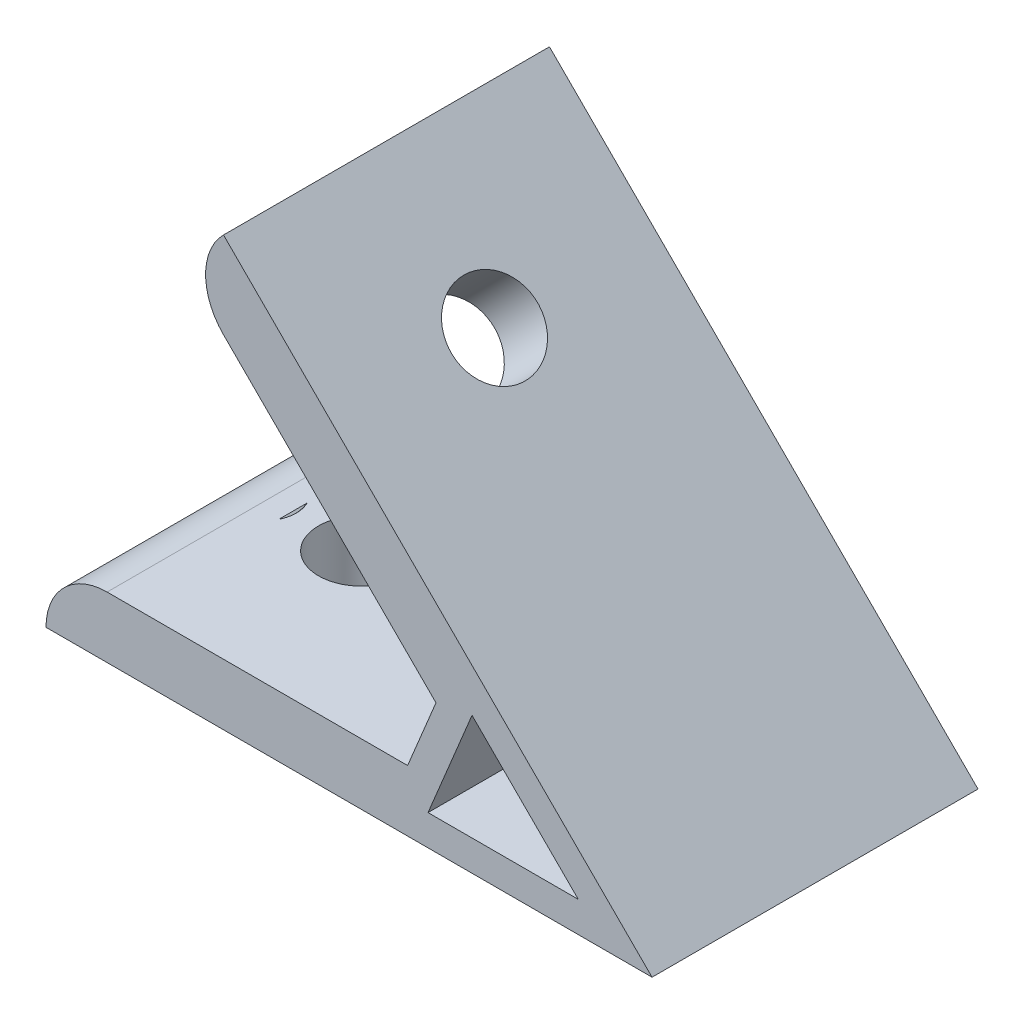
ISO-10303-21;
HEADER;
FILE_DESCRIPTION(('STEP AP214'),'2;1');
FILE_NAME('part.step','',(''),(''),'','','');
FILE_SCHEMA(('AUTOMOTIVE_DESIGN { 1 0 10303 214 1 1 1 1 }'));
ENDSEC;
DATA;
#1=APPLICATION_CONTEXT('core data for automotive mechanical design processes');
#2=APPLICATION_PROTOCOL_DEFINITION('international standard','automotive_design',2000,#1);
#3=PRODUCT_CONTEXT('',#1,'mechanical');
#4=PRODUCT('Part','Part','',(#3));
#5=PRODUCT_RELATED_PRODUCT_CATEGORY('part','',(#4));
#6=PRODUCT_DEFINITION_FORMATION('','',#4);
#7=PRODUCT_DEFINITION_CONTEXT('part definition',#1,'design');
#8=PRODUCT_DEFINITION('design','',#6,#7);
#9=PRODUCT_DEFINITION_SHAPE('','',#8);
#10=(LENGTH_UNIT() NAMED_UNIT(*) SI_UNIT(.MILLI.,.METRE.));
#11=(NAMED_UNIT(*) PLANE_ANGLE_UNIT() SI_UNIT($,.RADIAN.));
#12=(NAMED_UNIT(*) SI_UNIT($,.STERADIAN.) SOLID_ANGLE_UNIT());
#13=UNCERTAINTY_MEASURE_WITH_UNIT(LENGTH_MEASURE(1.E-05),#10,'distance_accuracy_value','');
#14=(GEOMETRIC_REPRESENTATION_CONTEXT(3) GLOBAL_UNCERTAINTY_ASSIGNED_CONTEXT((#13)) GLOBAL_UNIT_ASSIGNED_CONTEXT((#10,
#11,#12)) REPRESENTATION_CONTEXT('',''));
#15=CARTESIAN_POINT('',(0.,0.,0.));
#16=DIRECTION('',(0.,0.,1.));
#17=DIRECTION('',(1.,0.,0.));
#18=AXIS2_PLACEMENT_3D('',#15,#16,#17);
#19=CARTESIAN_POINT('',(0.,0.,16.));
#20=DIRECTION('',(0.,1.,0.));
#21=DIRECTION('',(0.,0.,1.));
#22=AXIS2_PLACEMENT_3D('',#19,#20,#21);
#23=PLANE('',#22);
#24=DIRECTION('',(1.,0.,0.));
#25=VECTOR('',#24,1.);
#26=CARTESIAN_POINT('',(0.,0.,-16.));
#27=LINE('',#26,#25);
#28=CARTESIAN_POINT('',(0.,0.,-16.));
#29=VERTEX_POINT('',#28);
#30=CARTESIAN_POINT('',(59.5,0.,-16.));
#31=VERTEX_POINT('',#30);
#32=EDGE_CURVE('E163',#29,#31,#27,.T.);
#33=ORIENTED_EDGE('',*,*,#32,.T.);
#34=DIRECTION('',(0.,0.,-1.));
#35=VECTOR('',#34,1.);
#36=CARTESIAN_POINT('',(59.5,0.,16.));
#37=LINE('',#36,#35);
#38=CARTESIAN_POINT('',(59.5,0.,16.));
#39=VERTEX_POINT('',#38);
#40=EDGE_CURVE('E199',#39,#31,#37,.T.);
#41=ORIENTED_EDGE('',*,*,#40,.F.);
#42=DIRECTION('',(1.,0.,0.));
#43=VECTOR('',#42,1.);
#44=CARTESIAN_POINT('',(0.,0.,16.));
#45=LINE('',#44,#43);
#46=CARTESIAN_POINT('',(0.,0.,16.));
#47=VERTEX_POINT('',#46);
#48=EDGE_CURVE('E168',#47,#39,#45,.T.);
#49=ORIENTED_EDGE('',*,*,#48,.F.);
#50=DIRECTION('',(0.,0.,-1.));
#51=VECTOR('',#50,1.);
#52=CARTESIAN_POINT('',(0.,0.,16.));
#53=LINE('',#52,#51);
#54=EDGE_CURVE('E202',#47,#29,#53,.T.);
#55=ORIENTED_EDGE('',*,*,#54,.T.);
#56=EDGE_LOOP('',(#33,#41,#49,#55));
#57=FACE_BOUND('',#56,.T.);
#58=CARTESIAN_POINT('',(15.,0.,0.));
#59=DIRECTION('',(0.,1.,0.));
#60=DIRECTION('',(-1.,0.,0.));
#61=AXIS2_PLACEMENT_3D('',#58,#59,#60);
#62=CIRCLE('',#61,4.25);
#63=CARTESIAN_POINT('',(10.75,0.,0.));
#64=VERTEX_POINT('',#63);
#65=EDGE_CURVE('E129',#64,#64,#62,.T.);
#66=ORIENTED_EDGE('',*,*,#65,.T.);
#67=EDGE_LOOP('',(#66));
#68=FACE_BOUND('',#67,.T.);
#69=ADVANCED_FACE('F36',(#57,#68),#23,.F.);
#70=CARTESIAN_POINT('',(13.1845058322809,37.83021279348,16.));
#71=DIRECTION('',(0.707106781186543,0.707106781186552,0.));
#72=DIRECTION('',(-0.707106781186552,0.707106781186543,0.));
#73=AXIS2_PLACEMENT_3D('',#70,#71,#72);
#74=PLANE('',#73);
#75=DIRECTION('',(0.707106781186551,-0.707106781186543,0.));
#76=VECTOR('',#75,1.);
#77=CARTESIAN_POINT('',(13.1845058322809,37.83021279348,16.));
#78=LINE('',#77,#76);
#79=CARTESIAN_POINT('',(17.4271465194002,33.5875721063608,16.));
#80=VERTEX_POINT('',#79);
#81=CARTESIAN_POINT('',(38.2867965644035,12.7279220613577,16.));
#82=VERTEX_POINT('',#81);
#83=EDGE_CURVE('E173',#80,#82,#78,.T.);
#84=ORIENTED_EDGE('',*,*,#83,.F.);
#85=DIRECTION('',(0.,0.,-1.));
#86=VECTOR('',#85,1.);
#87=CARTESIAN_POINT('',(17.4271465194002,33.5875721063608,16.));
#88=LINE('',#87,#86);
#89=CARTESIAN_POINT('',(17.4271465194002,33.5875721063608,-16.));
#90=VERTEX_POINT('',#89);
#91=EDGE_CURVE('E205',#80,#90,#88,.T.);
#92=ORIENTED_EDGE('',*,*,#91,.T.);
#93=DIRECTION('',(0.707106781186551,-0.707106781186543,0.));
#94=VECTOR('',#93,1.);
#95=CARTESIAN_POINT('',(13.1845058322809,37.83021279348,-16.));
#96=LINE('',#95,#94);
#97=CARTESIAN_POINT('',(38.2867965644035,12.7279220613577,-16.));
#98=VERTEX_POINT('',#97);
#99=EDGE_CURVE('E185',#90,#98,#96,.T.);
#100=ORIENTED_EDGE('',*,*,#99,.T.);
#101=DIRECTION('',(0.,0.,-1.));
#102=VECTOR('',#101,1.);
#103=CARTESIAN_POINT('',(38.2867965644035,12.7279220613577,16.));
#104=LINE('',#103,#102);
#105=EDGE_CURVE('E193',#82,#98,#104,.T.);
#106=ORIENTED_EDGE('',*,*,#105,.F.);
#107=EDGE_LOOP('',(#84,#92,#100,#106));
#108=FACE_BOUND('',#107,.T.);
#109=CARTESIAN_POINT('',(23.7911075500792,27.2236110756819,0.));
#110=DIRECTION('',(0.707106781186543,0.707106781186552,0.));
#111=DIRECTION('',(-0.707106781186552,0.707106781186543,0.));
#112=AXIS2_PLACEMENT_3D('',#109,#110,#111);
#113=CIRCLE('',#112,4.25);
#114=CARTESIAN_POINT('',(20.7859037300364,30.2288148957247,0.));
#115=VERTEX_POINT('',#114);
#116=EDGE_CURVE('E139',#115,#115,#113,.T.);
#117=ORIENTED_EDGE('',*,*,#116,.T.);
#118=EDGE_LOOP('',(#117));
#119=FACE_BOUND('',#118,.T.);
#120=CARTESIAN_POINT('',(15.,36.014718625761,0.));
#121=DIRECTION('',(0.707106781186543,0.707106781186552,0.));
#122=DIRECTION('',(0.707106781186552,-0.707106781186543,0.));
#123=AXIS2_PLACEMENT_3D('',#120,#121,#122);
#124=ELLIPSE('',#123,6.01040764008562,4.25);
#125=CARTESIAN_POINT('',(19.014718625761,32.,-1.39446561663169));
#126=VERTEX_POINT('',#125);
#127=CARTESIAN_POINT('',(19.014718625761,32.,1.39446561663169));
#128=VERTEX_POINT('',#127);
#129=EDGE_CURVE('E127',#126,#128,#124,.F.);
#130=ORIENTED_EDGE('',*,*,#129,.F.);
#131=DIRECTION('',(0.,0.,-1.));
#132=VECTOR('',#131,1.);
#133=CARTESIAN_POINT('',(19.014718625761,32.,16.));
#134=LINE('',#133,#132);
#135=EDGE_CURVE('E11',#128,#126,#134,.T.);
#136=ORIENTED_EDGE('',*,*,#135,.F.);
#137=EDGE_LOOP('',(#130,#136));
#138=FACE_BOUND('',#137,.T.);
#139=ADVANCED_FACE('F131',(#108,#119,#138),#74,.F.);
#140=CARTESIAN_POINT('',(35.5,6.,16.));
#141=DIRECTION('',(0.,-1.,0.));
#142=DIRECTION('',(1.,0.,0.));
#143=AXIS2_PLACEMENT_3D('',#140,#141,#142);
#144=PLANE('',#143);
#145=DIRECTION('',(-1.,0.,0.));
#146=VECTOR('',#145,1.);
#147=CARTESIAN_POINT('',(35.5,6.,-16.));
#148=LINE('',#147,#146);
#149=CARTESIAN_POINT('',(35.5,6.,-16.));
#150=VERTEX_POINT('',#149);
#151=CARTESIAN_POINT('',(6.,6.,-16.));
#152=VERTEX_POINT('',#151);
#153=EDGE_CURVE('E171',#150,#152,#148,.T.);
#154=ORIENTED_EDGE('',*,*,#153,.T.);
#155=DIRECTION('',(0.,0.,-1.));
#156=VECTOR('',#155,1.);
#157=CARTESIAN_POINT('',(6.,6.,16.));
#158=LINE('',#157,#156);
#159=CARTESIAN_POINT('',(6.,6.,16.));
#160=VERTEX_POINT('',#159);
#161=EDGE_CURVE('E214',#152,#160,#158,.F.);
#162=ORIENTED_EDGE('',*,*,#161,.T.);
#163=DIRECTION('',(-1.,0.,0.));
#164=VECTOR('',#163,1.);
#165=CARTESIAN_POINT('',(35.5,6.,16.));
#166=LINE('',#165,#164);
#167=CARTESIAN_POINT('',(35.5,6.,16.));
#168=VERTEX_POINT('',#167);
#169=EDGE_CURVE('E177',#168,#160,#166,.T.);
#170=ORIENTED_EDGE('',*,*,#169,.F.);
#171=DIRECTION('',(0.,0.,-1.));
#172=VECTOR('',#171,1.);
#173=CARTESIAN_POINT('',(35.5,6.,16.));
#174=LINE('',#173,#172);
#175=EDGE_CURVE('E180',#168,#150,#174,.T.);
#176=ORIENTED_EDGE('',*,*,#175,.T.);
#177=EDGE_LOOP('',(#154,#162,#170,#176));
#178=FACE_BOUND('',#177,.T.);
#179=DIRECTION('',(0.,0.,1.));
#180=VECTOR('',#179,1.);
#181=CARTESIAN_POINT('',(8.24516600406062,6.,16.));
#182=LINE('',#181,#180);
#183=CARTESIAN_POINT('',(8.24516600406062,6.,-1.39446561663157));
#184=VERTEX_POINT('',#183);
#185=CARTESIAN_POINT('',(8.24516600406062,6.,1.39446561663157));
#186=VERTEX_POINT('',#185);
#187=EDGE_CURVE('E218',#184,#186,#182,.T.);
#188=ORIENTED_EDGE('',*,*,#187,.F.);
#189=CARTESIAN_POINT('',(2.56749647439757,6.,0.));
#190=DIRECTION('',(0.,-1.,0.));
#191=DIRECTION('',(1.,0.,0.));
#192=AXIS2_PLACEMENT_3D('',#189,#190,#191);
#193=ELLIPSE('',#192,6.01040764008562,4.25);
#194=EDGE_CURVE('E44',#184,#186,#193,.T.);
#195=ORIENTED_EDGE('',*,*,#194,.T.);
#196=EDGE_LOOP('',(#188,#195));
#197=FACE_BOUND('',#196,.T.);
#198=CARTESIAN_POINT('',(15.,6.,0.));
#199=DIRECTION('',(0.,-1.,0.));
#200=DIRECTION('',(1.,0.,0.));
#201=AXIS2_PLACEMENT_3D('',#198,#199,#200);
#202=CIRCLE('',#201,4.25);
#203=CARTESIAN_POINT('',(19.25,6.,0.));
#204=VERTEX_POINT('',#203);
#205=EDGE_CURVE('E128',#204,#204,#202,.F.);
#206=ORIENTED_EDGE('',*,*,#205,.F.);
#207=EDGE_LOOP('',(#206));
#208=FACE_BOUND('',#207,.T.);
#209=ADVANCED_FACE('F223',(#178,#197,#208),#144,.F.);
#210=CARTESIAN_POINT('',(59.5,0.,16.));
#211=DIRECTION('',(-0.707106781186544,-0.707106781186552,0.));
#212=DIRECTION('',(0.707106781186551,-0.707106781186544,0.));
#213=AXIS2_PLACEMENT_3D('',#210,#211,#212);
#214=PLANE('',#213);
#215=CARTESIAN_POINT('',(28.0337482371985,31.4662517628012,0.));
#216=DIRECTION('',(0.707106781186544,0.707106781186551,0.));
#217=DIRECTION('',(-0.707106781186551,0.707106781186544,0.));
#218=AXIS2_PLACEMENT_3D('',#215,#216,#217);
#219=CIRCLE('',#218,4.25);
#220=CARTESIAN_POINT('',(25.0285444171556,34.471455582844,0.));
#221=VERTEX_POINT('',#220);
#222=EDGE_CURVE('E132',#221,#221,#219,.T.);
#223=ORIENTED_EDGE('',*,*,#222,.F.);
#224=EDGE_LOOP('',(#223));
#225=FACE_BOUND('',#224,.T.);
#226=DIRECTION('',(-0.707106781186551,0.707106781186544,0.));
#227=VECTOR('',#226,1.);
#228=CARTESIAN_POINT('',(59.5,0.,-16.));
#229=LINE('',#228,#227);
#230=CARTESIAN_POINT('',(17.4271465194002,42.0728534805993,-16.));
#231=VERTEX_POINT('',#230);
#232=EDGE_CURVE('E182',#31,#231,#229,.T.);
#233=ORIENTED_EDGE('',*,*,#232,.T.);
#234=DIRECTION('',(0.,0.,-1.));
#235=VECTOR('',#234,1.);
#236=CARTESIAN_POINT('',(17.4271465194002,42.0728534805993,16.));
#237=LINE('',#236,#235);
#238=CARTESIAN_POINT('',(17.4271465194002,42.0728534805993,16.));
#239=VERTEX_POINT('',#238);
#240=EDGE_CURVE('E196',#239,#231,#237,.T.);
#241=ORIENTED_EDGE('',*,*,#240,.F.);
#242=DIRECTION('',(-0.707106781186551,0.707106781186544,0.));
#243=VECTOR('',#242,1.);
#244=CARTESIAN_POINT('',(59.5,0.,16.));
#245=LINE('',#244,#243);
#246=EDGE_CURVE('E170',#39,#239,#245,.T.);
#247=ORIENTED_EDGE('',*,*,#246,.F.);
#248=ORIENTED_EDGE('',*,*,#40,.T.);
#249=EDGE_LOOP('',(#233,#241,#247,#248));
#250=FACE_BOUND('',#249,.T.);
#251=ADVANCED_FACE('F249',(#225,#250),#214,.F.);
#252=CARTESIAN_POINT('',(38.2867965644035,12.7279220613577,16.));
#253=DIRECTION('',(0.923879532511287,-0.382683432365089,0.));
#254=DIRECTION('',(0.382683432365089,0.923879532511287,0.));
#255=AXIS2_PLACEMENT_3D('',#252,#253,#254);
#256=PLANE('',#255);
#257=DIRECTION('',(-0.382683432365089,-0.923879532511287,0.));
#258=VECTOR('',#257,1.);
#259=CARTESIAN_POINT('',(38.2867965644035,12.7279220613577,-16.));
#260=LINE('',#259,#258);
#261=EDGE_CURVE('E187',#98,#150,#260,.T.);
#262=ORIENTED_EDGE('',*,*,#261,.T.);
#263=ORIENTED_EDGE('',*,*,#175,.F.);
#264=DIRECTION('',(-0.382683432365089,-0.923879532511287,0.));
#265=VECTOR('',#264,1.);
#266=CARTESIAN_POINT('',(38.2867965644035,12.7279220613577,16.));
#267=LINE('',#266,#265);
#268=EDGE_CURVE('E175',#82,#168,#267,.T.);
#269=ORIENTED_EDGE('',*,*,#268,.F.);
#270=ORIENTED_EDGE('',*,*,#105,.T.);
#271=EDGE_LOOP('',(#262,#263,#269,#270));
#272=FACE_BOUND('',#271,.T.);
#273=ADVANCED_FACE('F276',(#272),#256,.F.);
#274=CARTESIAN_POINT('',(0.,0.,16.));
#275=DIRECTION('',(0.,0.,1.));
#276=DIRECTION('',(1.,0.,0.));
#277=AXIS2_PLACEMENT_3D('',#274,#275,#276);
#278=PLANE('',#277);
#279=DIRECTION('',(-0.707106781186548,0.707106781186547,0.));
#280=VECTOR('',#279,1.);
#281=CARTESIAN_POINT('',(41.8255378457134,13.4318214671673,16.));
#282=LINE('',#281,#280);
#283=CARTESIAN_POINT('',(52.2573593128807,3.,16.));
#284=VERTEX_POINT('',#283);
#285=CARTESIAN_POINT('',(41.8255378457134,13.4318214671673,16.));
#286=VERTEX_POINT('',#285);
#287=EDGE_CURVE('E143',#284,#286,#282,.T.);
#288=ORIENTED_EDGE('',*,*,#287,.F.);
#289=DIRECTION('',(1.,0.,0.));
#290=VECTOR('',#289,1.);
#291=CARTESIAN_POINT('',(52.2573593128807,3.,16.));
#292=LINE('',#291,#290);
#293=CARTESIAN_POINT('',(37.5045359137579,3.,16.));
#294=VERTEX_POINT('',#293);
#295=EDGE_CURVE('E148',#294,#284,#292,.T.);
#296=ORIENTED_EDGE('',*,*,#295,.F.);
#297=DIRECTION('',(-0.382683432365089,-0.923879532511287,0.));
#298=VECTOR('',#297,1.);
#299=CARTESIAN_POINT('',(41.8255378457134,13.4318214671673,16.));
#300=LINE('',#299,#298);
#301=EDGE_CURVE('E156',#286,#294,#300,.T.);
#302=ORIENTED_EDGE('',*,*,#301,.F.);
#303=EDGE_LOOP('',(#288,#296,#302));
#304=FACE_BOUND('',#303,.T.);
#305=ORIENTED_EDGE('',*,*,#169,.T.);
#306=CARTESIAN_POINT('',(6.,0.,16.));
#307=DIRECTION('',(0.,0.,1.));
#308=DIRECTION('',(1.,0.,0.));
#309=AXIS2_PLACEMENT_3D('',#306,#307,#308);
#310=CIRCLE('',#309,6.);
#311=EDGE_CURVE('E216',#160,#47,#310,.T.);
#312=ORIENTED_EDGE('',*,*,#311,.T.);
#313=ORIENTED_EDGE('',*,*,#48,.T.);
#314=ORIENTED_EDGE('',*,*,#246,.T.);
#315=CARTESIAN_POINT('',(21.6697872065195,37.8302127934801,16.));
#316=DIRECTION('',(0.,0.,1.));
#317=DIRECTION('',(1.,0.,0.));
#318=AXIS2_PLACEMENT_3D('',#315,#316,#317);
#319=CIRCLE('',#318,6.);
#320=EDGE_CURVE('E210',#239,#80,#319,.T.);
#321=ORIENTED_EDGE('',*,*,#320,.T.);
#322=ORIENTED_EDGE('',*,*,#83,.T.);
#323=ORIENTED_EDGE('',*,*,#268,.T.);
#324=EDGE_LOOP('',(#305,#312,#313,#314,#321,#322,#323));
#325=FACE_BOUND('',#324,.T.);
#326=ADVANCED_FACE('F267',(#304,#325),#278,.T.);
#327=CARTESIAN_POINT('',(0.,0.,-16.));
#328=DIRECTION('',(0.,0.,1.));
#329=DIRECTION('',(1.,0.,0.));
#330=AXIS2_PLACEMENT_3D('',#327,#328,#329);
#331=PLANE('',#330);
#332=DIRECTION('',(1.,0.,0.));
#333=VECTOR('',#332,1.);
#334=CARTESIAN_POINT('',(52.2573593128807,3.,-16.));
#335=LINE('',#334,#333);
#336=CARTESIAN_POINT('',(37.5045359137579,3.,-16.));
#337=VERTEX_POINT('',#336);
#338=CARTESIAN_POINT('',(52.2573593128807,3.,-16.));
#339=VERTEX_POINT('',#338);
#340=EDGE_CURVE('E151',#337,#339,#335,.T.);
#341=ORIENTED_EDGE('',*,*,#340,.T.);
#342=DIRECTION('',(-0.707106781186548,0.707106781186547,0.));
#343=VECTOR('',#342,1.);
#344=CARTESIAN_POINT('',(41.8255378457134,13.4318214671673,-16.));
#345=LINE('',#344,#343);
#346=CARTESIAN_POINT('',(41.8255378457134,13.4318214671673,-16.));
#347=VERTEX_POINT('',#346);
#348=EDGE_CURVE('E144',#339,#347,#345,.T.);
#349=ORIENTED_EDGE('',*,*,#348,.T.);
#350=DIRECTION('',(-0.382683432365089,-0.923879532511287,0.));
#351=VECTOR('',#350,1.);
#352=CARTESIAN_POINT('',(41.8255378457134,13.4318214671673,-16.));
#353=LINE('',#352,#351);
#354=EDGE_CURVE('E147',#347,#337,#353,.T.);
#355=ORIENTED_EDGE('',*,*,#354,.T.);
#356=EDGE_LOOP('',(#341,#349,#355));
#357=FACE_BOUND('',#356,.T.);
#358=ORIENTED_EDGE('',*,*,#32,.F.);
#359=CARTESIAN_POINT('',(6.,0.,-16.));
#360=DIRECTION('',(0.,0.,1.));
#361=DIRECTION('',(1.,0.,0.));
#362=AXIS2_PLACEMENT_3D('',#359,#360,#361);
#363=CIRCLE('',#362,6.);
#364=EDGE_CURVE('E212',#29,#152,#363,.F.);
#365=ORIENTED_EDGE('',*,*,#364,.T.);
#366=ORIENTED_EDGE('',*,*,#153,.F.);
#367=ORIENTED_EDGE('',*,*,#261,.F.);
#368=ORIENTED_EDGE('',*,*,#99,.F.);
#369=CARTESIAN_POINT('',(21.6697872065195,37.8302127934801,-16.));
#370=DIRECTION('',(0.,0.,1.));
#371=DIRECTION('',(1.,0.,0.));
#372=AXIS2_PLACEMENT_3D('',#369,#370,#371);
#373=CIRCLE('',#372,6.);
#374=EDGE_CURVE('E208',#90,#231,#373,.F.);
#375=ORIENTED_EDGE('',*,*,#374,.T.);
#376=ORIENTED_EDGE('',*,*,#232,.F.);
#377=EDGE_LOOP('',(#358,#365,#366,#367,#368,#375,#376));
#378=FACE_BOUND('',#377,.T.);
#379=ADVANCED_FACE('F288',(#357,#378),#331,.F.);
#380=CARTESIAN_POINT('',(41.8255378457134,13.4318214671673,-16.));
#381=DIRECTION('',(0.707106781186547,0.707106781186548,0.));
#382=DIRECTION('',(-0.707106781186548,0.707106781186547,0.));
#383=AXIS2_PLACEMENT_3D('',#380,#381,#382);
#384=PLANE('',#383);
#385=ORIENTED_EDGE('',*,*,#287,.T.);
#386=DIRECTION('',(0.,0.,1.));
#387=VECTOR('',#386,1.);
#388=CARTESIAN_POINT('',(41.8255378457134,13.4318214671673,-16.));
#389=LINE('',#388,#387);
#390=EDGE_CURVE('E154',#347,#286,#389,.T.);
#391=ORIENTED_EDGE('',*,*,#390,.F.);
#392=ORIENTED_EDGE('',*,*,#348,.F.);
#393=DIRECTION('',(0.,0.,1.));
#394=VECTOR('',#393,1.);
#395=CARTESIAN_POINT('',(52.2573593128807,3.,-16.));
#396=LINE('',#395,#394);
#397=EDGE_CURVE('E161',#339,#284,#396,.T.);
#398=ORIENTED_EDGE('',*,*,#397,.T.);
#399=EDGE_LOOP('',(#385,#391,#392,#398));
#400=FACE_BOUND('',#399,.T.);
#401=ADVANCED_FACE('F307',(#400),#384,.F.);
#402=CARTESIAN_POINT('',(52.2573593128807,3.,-16.));
#403=DIRECTION('',(0.,-1.,0.));
#404=DIRECTION('',(1.,0.,0.));
#405=AXIS2_PLACEMENT_3D('',#402,#403,#404);
#406=PLANE('',#405);
#407=ORIENTED_EDGE('',*,*,#295,.T.);
#408=ORIENTED_EDGE('',*,*,#397,.F.);
#409=ORIENTED_EDGE('',*,*,#340,.F.);
#410=DIRECTION('',(0.,0.,1.));
#411=VECTOR('',#410,1.);
#412=CARTESIAN_POINT('',(37.5045359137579,3.,-16.));
#413=LINE('',#412,#411);
#414=EDGE_CURVE('E164',#337,#294,#413,.T.);
#415=ORIENTED_EDGE('',*,*,#414,.T.);
#416=EDGE_LOOP('',(#407,#408,#409,#415));
#417=FACE_BOUND('',#416,.T.);
#418=ADVANCED_FACE('F259',(#417),#406,.F.);
#419=CARTESIAN_POINT('',(41.8255378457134,13.4318214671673,-16.));
#420=DIRECTION('',(-0.923879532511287,0.382683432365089,0.));
#421=DIRECTION('',(-0.382683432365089,-0.923879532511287,0.));
#422=AXIS2_PLACEMENT_3D('',#419,#420,#421);
#423=PLANE('',#422);
#424=ORIENTED_EDGE('',*,*,#301,.T.);
#425=ORIENTED_EDGE('',*,*,#414,.F.);
#426=ORIENTED_EDGE('',*,*,#354,.F.);
#427=ORIENTED_EDGE('',*,*,#390,.T.);
#428=EDGE_LOOP('',(#424,#425,#426,#427));
#429=FACE_BOUND('',#428,.T.);
#430=ADVANCED_FACE('F252',(#429),#423,.F.);
#431=CARTESIAN_POINT('',(21.6697872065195,37.8302127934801,16.));
#432=DIRECTION('',(0.,0.,-1.));
#433=DIRECTION('',(-1.,0.,0.));
#434=AXIS2_PLACEMENT_3D('',#431,#432,#433);
#435=CYLINDRICAL_SURFACE('',#434,6.);
#436=ORIENTED_EDGE('',*,*,#320,.F.);
#437=ORIENTED_EDGE('',*,*,#240,.T.);
#438=ORIENTED_EDGE('',*,*,#374,.F.);
#439=ORIENTED_EDGE('',*,*,#91,.F.);
#440=EDGE_LOOP('',(#436,#437,#438,#439));
#441=FACE_BOUND('',#440,.T.);
#442=ADVANCED_FACE('F250',(#441),#435,.T.);
#443=CARTESIAN_POINT('',(6.,0.,16.));
#444=DIRECTION('',(0.,0.,-1.));
#445=DIRECTION('',(-1.,0.,0.));
#446=AXIS2_PLACEMENT_3D('',#443,#444,#445);
#447=CYLINDRICAL_SURFACE('',#446,6.);
#448=ORIENTED_EDGE('',*,*,#311,.F.);
#449=ORIENTED_EDGE('',*,*,#161,.F.);
#450=ORIENTED_EDGE('',*,*,#364,.F.);
#451=ORIENTED_EDGE('',*,*,#54,.F.);
#452=EDGE_LOOP('',(#448,#449,#450,#451));
#453=FACE_BOUND('',#452,.T.);
#454=ADVANCED_FACE('F38',(#453),#447,.T.);
#455=CARTESIAN_POINT('',(5.40633123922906,8.83883476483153,0.));
#456=DIRECTION('',(0.707106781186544,0.707106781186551,0.));
#457=DIRECTION('',(-0.707106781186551,0.707106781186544,0.));
#458=AXIS2_PLACEMENT_3D('',#455,#456,#457);
#459=PLANE('',#458);
#460=ORIENTED_EDGE('',*,*,#187,.T.);
#461=CARTESIAN_POINT('',(5.40633123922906,8.83883476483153,0.));
#462=DIRECTION('',(0.707106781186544,0.707106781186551,0.));
#463=DIRECTION('',(-0.707106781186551,0.707106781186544,0.));
#464=AXIS2_PLACEMENT_3D('',#461,#462,#463);
#465=CIRCLE('',#464,4.25);
#466=EDGE_CURVE('E56',#186,#184,#465,.T.);
#467=ORIENTED_EDGE('',*,*,#466,.T.);
#468=EDGE_LOOP('',(#460,#467));
#469=FACE_BOUND('',#468,.T.);
#470=ADVANCED_FACE('F229',(#469),#459,.T.);
#471=CARTESIAN_POINT('',(5.40633123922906,8.83883476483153,0.));
#472=DIRECTION('',(0.707106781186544,0.707106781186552,0.));
#473=DIRECTION('',(-0.707106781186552,0.707106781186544,0.));
#474=AXIS2_PLACEMENT_3D('',#471,#472,#473);
#475=CYLINDRICAL_SURFACE('',#474,4.25);
#476=ORIENTED_EDGE('',*,*,#466,.F.);
#477=ORIENTED_EDGE('',*,*,#194,.F.);
#478=EDGE_LOOP('',(#476,#477));
#479=FACE_BOUND('',#478,.T.);
#480=ADVANCED_FACE('F226',(#479),#475,.F.);
#481=ORIENTED_EDGE('',*,*,#222,.T.);
#482=EDGE_LOOP('',(#481));
#483=FACE_BOUND('',#482,.T.);
#484=ORIENTED_EDGE('',*,*,#116,.F.);
#485=EDGE_LOOP('',(#484));
#486=FACE_BOUND('',#485,.T.);
#487=ADVANCED_FACE('F228',(#483,#486),#475,.F.);
#488=CARTESIAN_POINT('',(15.,32.,0.));
#489=DIRECTION('',(0.,-1.,0.));
#490=DIRECTION('',(1.,0.,0.));
#491=AXIS2_PLACEMENT_3D('',#488,#489,#490);
#492=CYLINDRICAL_SURFACE('',#491,4.25);
#493=ORIENTED_EDGE('',*,*,#65,.F.);
#494=EDGE_LOOP('',(#493));
#495=FACE_BOUND('',#494,.T.);
#496=ORIENTED_EDGE('',*,*,#205,.T.);
#497=EDGE_LOOP('',(#496));
#498=FACE_BOUND('',#497,.T.);
#499=ADVANCED_FACE('F235',(#495,#498),#492,.F.);
#500=CARTESIAN_POINT('',(15.,32.,0.));
#501=DIRECTION('',(0.,-1.,0.));
#502=DIRECTION('',(-1.,0.,0.));
#503=AXIS2_PLACEMENT_3D('',#500,#501,#502);
#504=PLANE('',#503);
#505=ORIENTED_EDGE('',*,*,#135,.T.);
#506=CARTESIAN_POINT('',(15.,32.,0.));
#507=DIRECTION('',(0.,1.,0.));
#508=DIRECTION('',(-1.,0.,0.));
#509=AXIS2_PLACEMENT_3D('',#506,#507,#508);
#510=CIRCLE('',#509,4.25);
#511=EDGE_CURVE('E49',#128,#126,#510,.T.);
#512=ORIENTED_EDGE('',*,*,#511,.F.);
#513=EDGE_LOOP('',(#505,#512));
#514=FACE_BOUND('',#513,.T.);
#515=ADVANCED_FACE('F122',(#514),#504,.T.);
#516=ORIENTED_EDGE('',*,*,#129,.T.);
#517=ORIENTED_EDGE('',*,*,#511,.T.);
#518=EDGE_LOOP('',(#516,#517));
#519=FACE_BOUND('',#518,.T.);
#520=ADVANCED_FACE('F126',(#519),#492,.F.);
#521=CLOSED_SHELL('',(#69,#139,#209,#251,#273,#326,#379,#401,#418,#430,#442,#454,#470,#480,#487,
#499,#515,#520));
#522=MANIFOLD_SOLID_BREP('B2',#521);
#523=ADVANCED_BREP_SHAPE_REPRESENTATION('',(#18,#522),#14);
#524=SHAPE_DEFINITION_REPRESENTATION(#9,#523);
ENDSEC;
END-ISO-10303-21;
